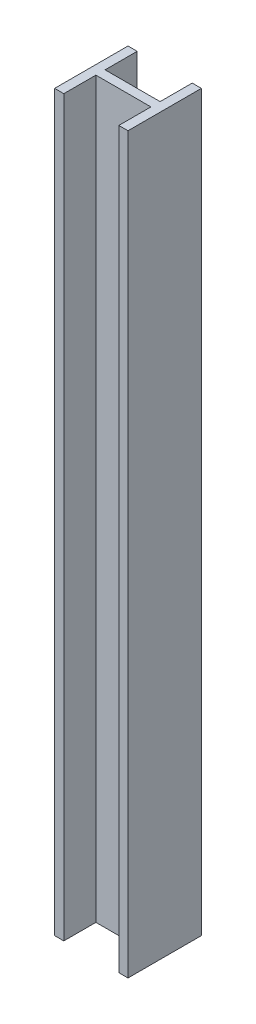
ISO-10303-21;
HEADER;
FILE_DESCRIPTION(('STEP AP214'),'2;1');
FILE_NAME('part.step','',(''),(''),'','','');
FILE_SCHEMA(('AUTOMOTIVE_DESIGN { 1 0 10303 214 1 1 1 1 }'));
ENDSEC;
DATA;
#1=APPLICATION_CONTEXT('core data for automotive mechanical design processes');
#2=APPLICATION_PROTOCOL_DEFINITION('international standard','automotive_design',2000,#1);
#3=PRODUCT_CONTEXT('',#1,'mechanical');
#4=PRODUCT('Part','Part','',(#3));
#5=PRODUCT_RELATED_PRODUCT_CATEGORY('part','',(#4));
#6=PRODUCT_DEFINITION_FORMATION('','',#4);
#7=PRODUCT_DEFINITION_CONTEXT('part definition',#1,'design');
#8=PRODUCT_DEFINITION('design','',#6,#7);
#9=PRODUCT_DEFINITION_SHAPE('','',#8);
#10=(LENGTH_UNIT() NAMED_UNIT(*) SI_UNIT(.MILLI.,.METRE.));
#11=(NAMED_UNIT(*) PLANE_ANGLE_UNIT() SI_UNIT($,.RADIAN.));
#12=(NAMED_UNIT(*) SI_UNIT($,.STERADIAN.) SOLID_ANGLE_UNIT());
#13=UNCERTAINTY_MEASURE_WITH_UNIT(LENGTH_MEASURE(1.E-05),#10,'distance_accuracy_value','');
#14=(GEOMETRIC_REPRESENTATION_CONTEXT(3) GLOBAL_UNCERTAINTY_ASSIGNED_CONTEXT((#13)) GLOBAL_UNIT_ASSIGNED_CONTEXT((#10,
#11,#12)) REPRESENTATION_CONTEXT('',''));
#15=CARTESIAN_POINT('',(0.,0.,0.));
#16=DIRECTION('',(0.,0.,1.));
#17=DIRECTION('',(1.,0.,0.));
#18=AXIS2_PLACEMENT_3D('',#15,#16,#17);
#19=CARTESIAN_POINT('',(19.05,508.,0.));
#20=DIRECTION('',(1.,0.,0.));
#21=DIRECTION('',(0.,0.,-1.));
#22=AXIS2_PLACEMENT_3D('',#19,#20,#21);
#23=PLANE('',#22);
#24=DIRECTION('',(0.,0.,1.));
#25=VECTOR('',#24,1.);
#26=CARTESIAN_POINT('',(19.05,0.,0.));
#27=LINE('',#26,#25);
#28=CARTESIAN_POINT('',(19.05,0.,-22.225));
#29=VERTEX_POINT('',#28);
#30=CARTESIAN_POINT('',(19.05,0.,0.));
#31=VERTEX_POINT('',#30);
#32=EDGE_CURVE('E152',#29,#31,#27,.T.);
#33=ORIENTED_EDGE('',*,*,#32,.T.);
#34=DIRECTION('',(0.,-1.,0.));
#35=VECTOR('',#34,1.);
#36=CARTESIAN_POINT('',(19.05,508.,0.));
#37=LINE('',#36,#35);
#38=CARTESIAN_POINT('',(19.05,508.,0.));
#39=VERTEX_POINT('',#38);
#40=EDGE_CURVE('E11',#39,#31,#37,.T.);
#41=ORIENTED_EDGE('',*,*,#40,.F.);
#42=DIRECTION('',(0.,0.,1.));
#43=VECTOR('',#42,1.);
#44=CARTESIAN_POINT('',(19.05,508.,0.));
#45=LINE('',#44,#43);
#46=CARTESIAN_POINT('',(19.05,508.,-22.225));
#47=VERTEX_POINT('',#46);
#48=EDGE_CURVE('E174',#47,#39,#45,.T.);
#49=ORIENTED_EDGE('',*,*,#48,.F.);
#50=DIRECTION('',(0.,-1.,0.));
#51=VECTOR('',#50,1.);
#52=CARTESIAN_POINT('',(19.05,508.,-22.225));
#53=LINE('',#52,#51);
#54=EDGE_CURVE('E148',#47,#29,#53,.T.);
#55=ORIENTED_EDGE('',*,*,#54,.T.);
#56=EDGE_LOOP('',(#33,#41,#49,#55));
#57=FACE_BOUND('',#56,.T.);
#58=ADVANCED_FACE('F32',(#57),#23,.F.);
#59=CARTESIAN_POINT('',(-19.05,508.,0.));
#60=DIRECTION('',(0.,0.,1.));
#61=DIRECTION('',(1.,0.,0.));
#62=AXIS2_PLACEMENT_3D('',#59,#60,#61);
#63=PLANE('',#62);
#64=DIRECTION('',(-1.,0.,0.));
#65=VECTOR('',#64,1.);
#66=CARTESIAN_POINT('',(-19.05,0.,0.));
#67=LINE('',#66,#65);
#68=CARTESIAN_POINT('',(-19.05,0.,0.));
#69=VERTEX_POINT('',#68);
#70=EDGE_CURVE('E155',#31,#69,#67,.T.);
#71=ORIENTED_EDGE('',*,*,#70,.T.);
#72=DIRECTION('',(0.,-1.,0.));
#73=VECTOR('',#72,1.);
#74=CARTESIAN_POINT('',(-19.05,508.,0.));
#75=LINE('',#74,#73);
#76=CARTESIAN_POINT('',(-19.05,508.,0.));
#77=VERTEX_POINT('',#76);
#78=EDGE_CURVE('E40',#77,#69,#75,.T.);
#79=ORIENTED_EDGE('',*,*,#78,.F.);
#80=DIRECTION('',(-1.,0.,0.));
#81=VECTOR('',#80,1.);
#82=CARTESIAN_POINT('',(-19.05,508.,0.));
#83=LINE('',#82,#81);
#84=EDGE_CURVE('E103',#39,#77,#83,.T.);
#85=ORIENTED_EDGE('',*,*,#84,.F.);
#86=ORIENTED_EDGE('',*,*,#40,.T.);
#87=EDGE_LOOP('',(#71,#79,#85,#86));
#88=FACE_BOUND('',#87,.T.);
#89=ADVANCED_FACE('F252',(#88),#63,.F.);
#90=CARTESIAN_POINT('',(-19.05,508.,0.));
#91=DIRECTION('',(-1.,0.,0.));
#92=DIRECTION('',(0.,0.,1.));
#93=AXIS2_PLACEMENT_3D('',#90,#91,#92);
#94=PLANE('',#93);
#95=DIRECTION('',(0.,0.,-1.));
#96=VECTOR('',#95,1.);
#97=CARTESIAN_POINT('',(-19.05,0.,0.));
#98=LINE('',#97,#96);
#99=CARTESIAN_POINT('',(-19.05,0.,-22.225));
#100=VERTEX_POINT('',#99);
#101=EDGE_CURVE('E157',#69,#100,#98,.T.);
#102=ORIENTED_EDGE('',*,*,#101,.T.);
#103=DIRECTION('',(0.,-1.,0.));
#104=VECTOR('',#103,1.);
#105=CARTESIAN_POINT('',(-19.05,508.,-22.225));
#106=LINE('',#105,#104);
#107=CARTESIAN_POINT('',(-19.05,508.,-22.225));
#108=VERTEX_POINT('',#107);
#109=EDGE_CURVE('E193',#108,#100,#106,.T.);
#110=ORIENTED_EDGE('',*,*,#109,.F.);
#111=DIRECTION('',(0.,0.,-1.));
#112=VECTOR('',#111,1.);
#113=CARTESIAN_POINT('',(-19.05,508.,0.));
#114=LINE('',#113,#112);
#115=EDGE_CURVE('E201',#77,#108,#114,.T.);
#116=ORIENTED_EDGE('',*,*,#115,.F.);
#117=ORIENTED_EDGE('',*,*,#78,.T.);
#118=EDGE_LOOP('',(#102,#110,#116,#117));
#119=FACE_BOUND('',#118,.T.);
#120=ADVANCED_FACE('F199',(#119),#94,.F.);
#121=CARTESIAN_POINT('',(-19.05,508.,-22.225));
#122=DIRECTION('',(0.,0.,1.));
#123=DIRECTION('',(1.,0.,0.));
#124=AXIS2_PLACEMENT_3D('',#121,#122,#123);
#125=PLANE('',#124);
#126=DIRECTION('',(-1.,0.,0.));
#127=VECTOR('',#126,1.);
#128=CARTESIAN_POINT('',(-19.05,0.,-22.225));
#129=LINE('',#128,#127);
#130=CARTESIAN_POINT('',(-25.4,0.,-22.225));
#131=VERTEX_POINT('',#130);
#132=EDGE_CURVE('E159',#100,#131,#129,.T.);
#133=ORIENTED_EDGE('',*,*,#132,.T.);
#134=DIRECTION('',(0.,-1.,0.));
#135=VECTOR('',#134,1.);
#136=CARTESIAN_POINT('',(-25.4,508.,-22.225));
#137=LINE('',#136,#135);
#138=CARTESIAN_POINT('',(-25.4,508.,-22.225));
#139=VERTEX_POINT('',#138);
#140=EDGE_CURVE('E190',#139,#131,#137,.T.);
#141=ORIENTED_EDGE('',*,*,#140,.F.);
#142=DIRECTION('',(-1.,0.,0.));
#143=VECTOR('',#142,1.);
#144=CARTESIAN_POINT('',(-19.05,508.,-22.225));
#145=LINE('',#144,#143);
#146=EDGE_CURVE('E219',#108,#139,#145,.T.);
#147=ORIENTED_EDGE('',*,*,#146,.F.);
#148=ORIENTED_EDGE('',*,*,#109,.T.);
#149=EDGE_LOOP('',(#133,#141,#147,#148));
#150=FACE_BOUND('',#149,.T.);
#151=ADVANCED_FACE('F210',(#150),#125,.F.);
#152=CARTESIAN_POINT('',(-25.4,508.,-22.225));
#153=DIRECTION('',(1.,0.,0.));
#154=DIRECTION('',(0.,0.,-1.));
#155=AXIS2_PLACEMENT_3D('',#152,#153,#154);
#156=PLANE('',#155);
#157=DIRECTION('',(0.,0.,1.));
#158=VECTOR('',#157,1.);
#159=CARTESIAN_POINT('',(-25.4,0.,-22.225));
#160=LINE('',#159,#158);
#161=CARTESIAN_POINT('',(-25.4,0.,28.575));
#162=VERTEX_POINT('',#161);
#163=EDGE_CURVE('E161',#131,#162,#160,.T.);
#164=ORIENTED_EDGE('',*,*,#163,.T.);
#165=DIRECTION('',(0.,-1.,0.));
#166=VECTOR('',#165,1.);
#167=CARTESIAN_POINT('',(-25.4,508.,28.575));
#168=LINE('',#167,#166);
#169=CARTESIAN_POINT('',(-25.4,508.,28.575));
#170=VERTEX_POINT('',#169);
#171=EDGE_CURVE('E187',#170,#162,#168,.T.);
#172=ORIENTED_EDGE('',*,*,#171,.F.);
#173=DIRECTION('',(0.,0.,1.));
#174=VECTOR('',#173,1.);
#175=CARTESIAN_POINT('',(-25.4,508.,-22.225));
#176=LINE('',#175,#174);
#177=EDGE_CURVE('E216',#139,#170,#176,.T.);
#178=ORIENTED_EDGE('',*,*,#177,.F.);
#179=ORIENTED_EDGE('',*,*,#140,.T.);
#180=EDGE_LOOP('',(#164,#172,#178,#179));
#181=FACE_BOUND('',#180,.T.);
#182=ADVANCED_FACE('F214',(#181),#156,.F.);
#183=CARTESIAN_POINT('',(-25.4,508.,28.575));
#184=DIRECTION('',(0.,0.,-1.));
#185=DIRECTION('',(-1.,0.,0.));
#186=AXIS2_PLACEMENT_3D('',#183,#184,#185);
#187=PLANE('',#186);
#188=DIRECTION('',(1.,0.,0.));
#189=VECTOR('',#188,1.);
#190=CARTESIAN_POINT('',(-25.4,0.,28.575));
#191=LINE('',#190,#189);
#192=CARTESIAN_POINT('',(-19.05,0.,28.575));
#193=VERTEX_POINT('',#192);
#194=EDGE_CURVE('E163',#162,#193,#191,.T.);
#195=ORIENTED_EDGE('',*,*,#194,.T.);
#196=DIRECTION('',(0.,-1.,0.));
#197=VECTOR('',#196,1.);
#198=CARTESIAN_POINT('',(-19.05,508.,28.575));
#199=LINE('',#198,#197);
#200=CARTESIAN_POINT('',(-19.05,508.,28.575));
#201=VERTEX_POINT('',#200);
#202=EDGE_CURVE('E184',#201,#193,#199,.T.);
#203=ORIENTED_EDGE('',*,*,#202,.F.);
#204=DIRECTION('',(1.,0.,0.));
#205=VECTOR('',#204,1.);
#206=CARTESIAN_POINT('',(-25.4,508.,28.575));
#207=LINE('',#206,#205);
#208=EDGE_CURVE('E218',#170,#201,#207,.T.);
#209=ORIENTED_EDGE('',*,*,#208,.F.);
#210=ORIENTED_EDGE('',*,*,#171,.T.);
#211=EDGE_LOOP('',(#195,#203,#209,#210));
#212=FACE_BOUND('',#211,.T.);
#213=ADVANCED_FACE('F265',(#212),#187,.F.);
#214=CARTESIAN_POINT('',(-19.05,508.,28.575));
#215=DIRECTION('',(-1.,0.,0.));
#216=DIRECTION('',(0.,0.,1.));
#217=AXIS2_PLACEMENT_3D('',#214,#215,#216);
#218=PLANE('',#217);
#219=DIRECTION('',(0.,0.,-1.));
#220=VECTOR('',#219,1.);
#221=CARTESIAN_POINT('',(-19.05,0.,28.575));
#222=LINE('',#221,#220);
#223=CARTESIAN_POINT('',(-19.05,0.,6.35));
#224=VERTEX_POINT('',#223);
#225=EDGE_CURVE('E165',#193,#224,#222,.T.);
#226=ORIENTED_EDGE('',*,*,#225,.T.);
#227=DIRECTION('',(0.,-1.,0.));
#228=VECTOR('',#227,1.);
#229=CARTESIAN_POINT('',(-19.05,508.,6.35));
#230=LINE('',#229,#228);
#231=CARTESIAN_POINT('',(-19.05,508.,6.35));
#232=VERTEX_POINT('',#231);
#233=EDGE_CURVE('E181',#232,#224,#230,.T.);
#234=ORIENTED_EDGE('',*,*,#233,.F.);
#235=DIRECTION('',(0.,0.,-1.));
#236=VECTOR('',#235,1.);
#237=CARTESIAN_POINT('',(-19.05,508.,28.575));
#238=LINE('',#237,#236);
#239=EDGE_CURVE('E221',#201,#232,#238,.T.);
#240=ORIENTED_EDGE('',*,*,#239,.F.);
#241=ORIENTED_EDGE('',*,*,#202,.T.);
#242=EDGE_LOOP('',(#226,#234,#240,#241));
#243=FACE_BOUND('',#242,.T.);
#244=ADVANCED_FACE('F268',(#243),#218,.F.);
#245=CARTESIAN_POINT('',(19.05,508.,6.35));
#246=DIRECTION('',(0.,0.,-1.));
#247=DIRECTION('',(-1.,0.,0.));
#248=AXIS2_PLACEMENT_3D('',#245,#246,#247);
#249=PLANE('',#248);
#250=DIRECTION('',(1.,0.,0.));
#251=VECTOR('',#250,1.);
#252=CARTESIAN_POINT('',(19.05,0.,6.35));
#253=LINE('',#252,#251);
#254=CARTESIAN_POINT('',(19.05,0.,6.35));
#255=VERTEX_POINT('',#254);
#256=EDGE_CURVE('E167',#224,#255,#253,.T.);
#257=ORIENTED_EDGE('',*,*,#256,.T.);
#258=DIRECTION('',(0.,-1.,0.));
#259=VECTOR('',#258,1.);
#260=CARTESIAN_POINT('',(19.05,508.,6.35));
#261=LINE('',#260,#259);
#262=CARTESIAN_POINT('',(19.05,508.,6.35));
#263=VERTEX_POINT('',#262);
#264=EDGE_CURVE('E178',#263,#255,#261,.T.);
#265=ORIENTED_EDGE('',*,*,#264,.F.);
#266=DIRECTION('',(1.,0.,0.));
#267=VECTOR('',#266,1.);
#268=CARTESIAN_POINT('',(19.05,508.,6.35));
#269=LINE('',#268,#267);
#270=EDGE_CURVE('E227',#232,#263,#269,.T.);
#271=ORIENTED_EDGE('',*,*,#270,.F.);
#272=ORIENTED_EDGE('',*,*,#233,.T.);
#273=EDGE_LOOP('',(#257,#265,#271,#272));
#274=FACE_BOUND('',#273,.T.);
#275=ADVANCED_FACE('F233',(#274),#249,.F.);
#276=CARTESIAN_POINT('',(19.05,508.,28.575));
#277=DIRECTION('',(1.,0.,0.));
#278=DIRECTION('',(0.,0.,-1.));
#279=AXIS2_PLACEMENT_3D('',#276,#277,#278);
#280=PLANE('',#279);
#281=DIRECTION('',(0.,0.,1.));
#282=VECTOR('',#281,1.);
#283=CARTESIAN_POINT('',(19.05,0.,28.575));
#284=LINE('',#283,#282);
#285=CARTESIAN_POINT('',(19.05,0.,28.575));
#286=VERTEX_POINT('',#285);
#287=EDGE_CURVE('E169',#255,#286,#284,.T.);
#288=ORIENTED_EDGE('',*,*,#287,.T.);
#289=DIRECTION('',(0.,-1.,0.));
#290=VECTOR('',#289,1.);
#291=CARTESIAN_POINT('',(19.05,508.,28.575));
#292=LINE('',#291,#290);
#293=CARTESIAN_POINT('',(19.05,508.,28.575));
#294=VERTEX_POINT('',#293);
#295=EDGE_CURVE('E143',#294,#286,#292,.T.);
#296=ORIENTED_EDGE('',*,*,#295,.F.);
#297=DIRECTION('',(0.,0.,1.));
#298=VECTOR('',#297,1.);
#299=CARTESIAN_POINT('',(19.05,508.,28.575));
#300=LINE('',#299,#298);
#301=EDGE_CURVE('E134',#263,#294,#300,.T.);
#302=ORIENTED_EDGE('',*,*,#301,.F.);
#303=ORIENTED_EDGE('',*,*,#264,.T.);
#304=EDGE_LOOP('',(#288,#296,#302,#303));
#305=FACE_BOUND('',#304,.T.);
#306=ADVANCED_FACE('F237',(#305),#280,.F.);
#307=CARTESIAN_POINT('',(25.4,508.,28.575));
#308=DIRECTION('',(0.,0.,-1.));
#309=DIRECTION('',(-1.,0.,0.));
#310=AXIS2_PLACEMENT_3D('',#307,#308,#309);
#311=PLANE('',#310);
#312=DIRECTION('',(1.,0.,0.));
#313=VECTOR('',#312,1.);
#314=CARTESIAN_POINT('',(25.4,0.,28.575));
#315=LINE('',#314,#313);
#316=CARTESIAN_POINT('',(25.4,0.,28.575));
#317=VERTEX_POINT('',#316);
#318=EDGE_CURVE('E142',#286,#317,#315,.T.);
#319=ORIENTED_EDGE('',*,*,#318,.T.);
#320=DIRECTION('',(0.,-1.,0.));
#321=VECTOR('',#320,1.);
#322=CARTESIAN_POINT('',(25.4,508.,28.575));
#323=LINE('',#322,#321);
#324=CARTESIAN_POINT('',(25.4,508.,28.575));
#325=VERTEX_POINT('',#324);
#326=EDGE_CURVE('E139',#325,#317,#323,.T.);
#327=ORIENTED_EDGE('',*,*,#326,.F.);
#328=DIRECTION('',(1.,0.,0.));
#329=VECTOR('',#328,1.);
#330=CARTESIAN_POINT('',(25.4,508.,28.575));
#331=LINE('',#330,#329);
#332=EDGE_CURVE('E128',#294,#325,#331,.T.);
#333=ORIENTED_EDGE('',*,*,#332,.F.);
#334=ORIENTED_EDGE('',*,*,#295,.T.);
#335=EDGE_LOOP('',(#319,#327,#333,#334));
#336=FACE_BOUND('',#335,.T.);
#337=ADVANCED_FACE('F140',(#336),#311,.F.);
#338=CARTESIAN_POINT('',(25.4,508.,-22.225));
#339=DIRECTION('',(-1.,0.,0.));
#340=DIRECTION('',(0.,0.,1.));
#341=AXIS2_PLACEMENT_3D('',#338,#339,#340);
#342=PLANE('',#341);
#343=DIRECTION('',(0.,0.,-1.));
#344=VECTOR('',#343,1.);
#345=CARTESIAN_POINT('',(25.4,0.,-22.225));
#346=LINE('',#345,#344);
#347=CARTESIAN_POINT('',(25.4,0.,-22.225));
#348=VERTEX_POINT('',#347);
#349=EDGE_CURVE('E89',#317,#348,#346,.T.);
#350=ORIENTED_EDGE('',*,*,#349,.T.);
#351=DIRECTION('',(0.,-1.,0.));
#352=VECTOR('',#351,1.);
#353=CARTESIAN_POINT('',(25.4,508.,-22.225));
#354=LINE('',#353,#352);
#355=CARTESIAN_POINT('',(25.4,508.,-22.225));
#356=VERTEX_POINT('',#355);
#357=EDGE_CURVE('E144',#356,#348,#354,.T.);
#358=ORIENTED_EDGE('',*,*,#357,.F.);
#359=DIRECTION('',(0.,0.,-1.));
#360=VECTOR('',#359,1.);
#361=CARTESIAN_POINT('',(25.4,508.,-22.225));
#362=LINE('',#361,#360);
#363=EDGE_CURVE('E132',#325,#356,#362,.T.);
#364=ORIENTED_EDGE('',*,*,#363,.F.);
#365=ORIENTED_EDGE('',*,*,#326,.T.);
#366=EDGE_LOOP('',(#350,#358,#364,#365));
#367=FACE_BOUND('',#366,.T.);
#368=ADVANCED_FACE('F146',(#367),#342,.F.);
#369=CARTESIAN_POINT('',(19.05,508.,-22.225));
#370=DIRECTION('',(0.,0.,1.));
#371=DIRECTION('',(1.,0.,0.));
#372=AXIS2_PLACEMENT_3D('',#369,#370,#371);
#373=PLANE('',#372);
#374=DIRECTION('',(-1.,0.,0.));
#375=VECTOR('',#374,1.);
#376=CARTESIAN_POINT('',(19.05,0.,-22.225));
#377=LINE('',#376,#375);
#378=EDGE_CURVE('E95',#348,#29,#377,.T.);
#379=ORIENTED_EDGE('',*,*,#378,.T.);
#380=ORIENTED_EDGE('',*,*,#54,.F.);
#381=DIRECTION('',(-1.,0.,0.));
#382=VECTOR('',#381,1.);
#383=CARTESIAN_POINT('',(19.05,508.,-22.225));
#384=LINE('',#383,#382);
#385=EDGE_CURVE('E48',#356,#47,#384,.T.);
#386=ORIENTED_EDGE('',*,*,#385,.F.);
#387=ORIENTED_EDGE('',*,*,#357,.T.);
#388=EDGE_LOOP('',(#379,#380,#386,#387));
#389=FACE_BOUND('',#388,.T.);
#390=ADVANCED_FACE('F241',(#389),#373,.F.);
#391=CARTESIAN_POINT('',(19.05,508.,-22.225));
#392=DIRECTION('',(0.,-1.,0.));
#393=DIRECTION('',(0.,0.,-1.));
#394=AXIS2_PLACEMENT_3D('',#391,#392,#393);
#395=PLANE('',#394);
#396=ORIENTED_EDGE('',*,*,#48,.T.);
#397=ORIENTED_EDGE('',*,*,#84,.T.);
#398=ORIENTED_EDGE('',*,*,#115,.T.);
#399=ORIENTED_EDGE('',*,*,#146,.T.);
#400=ORIENTED_EDGE('',*,*,#177,.T.);
#401=ORIENTED_EDGE('',*,*,#208,.T.);
#402=ORIENTED_EDGE('',*,*,#239,.T.);
#403=ORIENTED_EDGE('',*,*,#270,.T.);
#404=ORIENTED_EDGE('',*,*,#301,.T.);
#405=ORIENTED_EDGE('',*,*,#332,.T.);
#406=ORIENTED_EDGE('',*,*,#363,.T.);
#407=ORIENTED_EDGE('',*,*,#385,.T.);
#408=EDGE_LOOP('',(#396,#397,#398,#399,#400,#401,#402,#403,#404,#405,#406,#407));
#409=FACE_BOUND('',#408,.T.);
#410=ADVANCED_FACE('F130',(#409),#395,.F.);
#411=CARTESIAN_POINT('',(19.05,0.,-22.225));
#412=DIRECTION('',(0.,-1.,0.));
#413=DIRECTION('',(0.,0.,-1.));
#414=AXIS2_PLACEMENT_3D('',#411,#412,#413);
#415=PLANE('',#414);
#416=ORIENTED_EDGE('',*,*,#32,.F.);
#417=ORIENTED_EDGE('',*,*,#378,.F.);
#418=ORIENTED_EDGE('',*,*,#349,.F.);
#419=ORIENTED_EDGE('',*,*,#318,.F.);
#420=ORIENTED_EDGE('',*,*,#287,.F.);
#421=ORIENTED_EDGE('',*,*,#256,.F.);
#422=ORIENTED_EDGE('',*,*,#225,.F.);
#423=ORIENTED_EDGE('',*,*,#194,.F.);
#424=ORIENTED_EDGE('',*,*,#163,.F.);
#425=ORIENTED_EDGE('',*,*,#132,.F.);
#426=ORIENTED_EDGE('',*,*,#101,.F.);
#427=ORIENTED_EDGE('',*,*,#70,.F.);
#428=EDGE_LOOP('',(#416,#417,#418,#419,#420,#421,#422,#423,#424,#425,#426,#427));
#429=FACE_BOUND('',#428,.T.);
#430=ADVANCED_FACE('F205',(#429),#415,.T.);
#431=CLOSED_SHELL('',(#58,#89,#120,#151,#182,#213,#244,#275,#306,#337,#368,#390,#410,#430));
#432=MANIFOLD_SOLID_BREP('B2',#431);
#433=ADVANCED_BREP_SHAPE_REPRESENTATION('',(#18,#432),#14);
#434=SHAPE_DEFINITION_REPRESENTATION(#9,#433);
ENDSEC;
END-ISO-10303-21;
